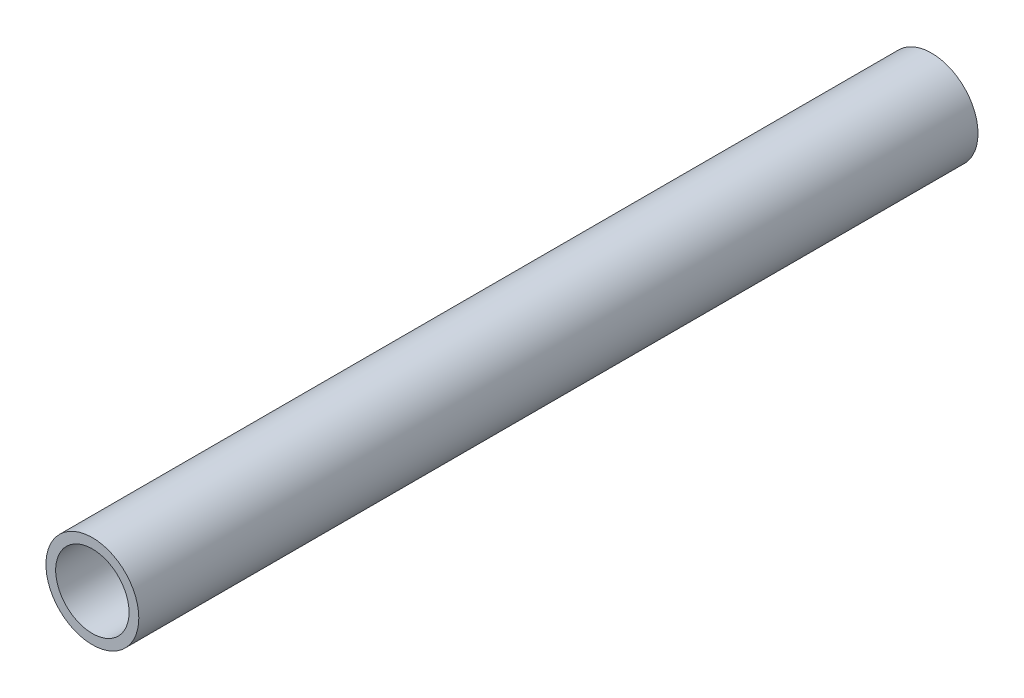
from build123d import *

# Parameters (mm, degrees)
BOSS_EXTRUDE1_DEPTH      = 152.4
BOSS_EXTRUDE1_DEPTH_BACK = 152.4
SKETCH3_R                = 16.8671875
SKETCH3_R_2              = 13.3223


with BuildPart() as part:
    # Sketch3 → Boss-Extrude1 (new, two sides: drawn at the far end of the back side and taken through both)
    with BuildSketch(Plane.XY.offset(-BOSS_EXTRUDE1_DEPTH_BACK)):
        Circle(SKETCH3_R)
        Circle(SKETCH3_R_2, mode=Mode.SUBTRACT)
    extrude(amount=BOSS_EXTRUDE1_DEPTH + BOSS_EXTRUDE1_DEPTH_BACK)


solid = part.part
